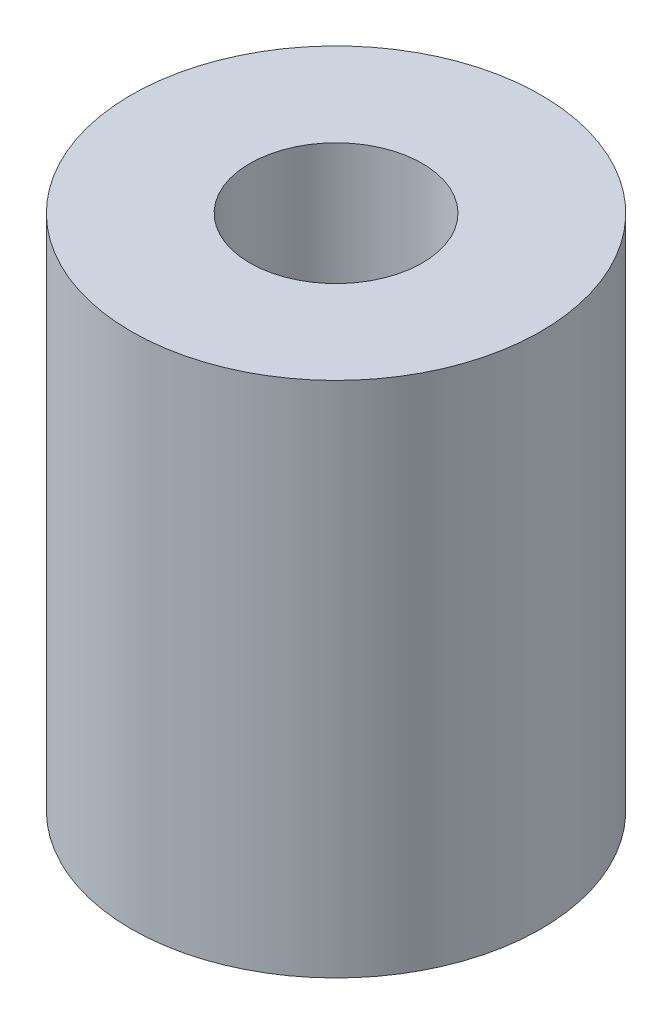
ISO-10303-21;
HEADER;
FILE_DESCRIPTION(('STEP AP214'),'2;1');
FILE_NAME('part.step','',(''),(''),'','','');
FILE_SCHEMA(('AUTOMOTIVE_DESIGN { 1 0 10303 214 1 1 1 1 }'));
ENDSEC;
DATA;
#1=APPLICATION_CONTEXT('core data for automotive mechanical design processes');
#2=APPLICATION_PROTOCOL_DEFINITION('international standard','automotive_design',2000,#1);
#3=PRODUCT_CONTEXT('',#1,'mechanical');
#4=PRODUCT('Part','Part','',(#3));
#5=PRODUCT_RELATED_PRODUCT_CATEGORY('part','',(#4));
#6=PRODUCT_DEFINITION_FORMATION('','',#4);
#7=PRODUCT_DEFINITION_CONTEXT('part definition',#1,'design');
#8=PRODUCT_DEFINITION('design','',#6,#7);
#9=PRODUCT_DEFINITION_SHAPE('','',#8);
#10=(LENGTH_UNIT() NAMED_UNIT(*) SI_UNIT(.MILLI.,.METRE.));
#11=(NAMED_UNIT(*) PLANE_ANGLE_UNIT() SI_UNIT($,.RADIAN.));
#12=(NAMED_UNIT(*) SI_UNIT($,.STERADIAN.) SOLID_ANGLE_UNIT());
#13=UNCERTAINTY_MEASURE_WITH_UNIT(LENGTH_MEASURE(1.E-05),#10,'distance_accuracy_value','');
#14=(GEOMETRIC_REPRESENTATION_CONTEXT(3) GLOBAL_UNCERTAINTY_ASSIGNED_CONTEXT((#13)) GLOBAL_UNIT_ASSIGNED_CONTEXT((#10,
#11,#12)) REPRESENTATION_CONTEXT('',''));
#15=CARTESIAN_POINT('',(0.,0.,0.));
#16=DIRECTION('',(0.,0.,1.));
#17=DIRECTION('',(1.,0.,0.));
#18=AXIS2_PLACEMENT_3D('',#15,#16,#17);
#19=CARTESIAN_POINT('',(0.,16.214782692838,0.));
#20=DIRECTION('',(0.,1.,0.));
#21=DIRECTION('',(0.,0.,1.));
#22=AXIS2_PLACEMENT_3D('',#19,#20,#21);
#23=CYLINDRICAL_SURFACE('',#22,4.);
#24=CARTESIAN_POINT('',(0.,-12.,0.));
#25=DIRECTION('',(0.,1.,0.));
#26=DIRECTION('',(0.,0.,1.));
#27=AXIS2_PLACEMENT_3D('',#24,#25,#26);
#28=CIRCLE('',#27,4.);
#29=CARTESIAN_POINT('',(0.,-12.,4.));
#30=VERTEX_POINT('',#29);
#31=EDGE_CURVE('E10',#30,#30,#28,.T.);
#32=ORIENTED_EDGE('',*,*,#31,.F.);
#33=EDGE_LOOP('',(#32));
#34=FACE_BOUND('',#33,.T.);
#35=CARTESIAN_POINT('',(0.,12.,0.));
#36=DIRECTION('',(0.,1.,0.));
#37=DIRECTION('',(0.,0.,1.));
#38=AXIS2_PLACEMENT_3D('',#35,#36,#37);
#39=CIRCLE('',#38,4.);
#40=CARTESIAN_POINT('',(0.,12.,4.));
#41=VERTEX_POINT('',#40);
#42=EDGE_CURVE('E47',#41,#41,#39,.T.);
#43=ORIENTED_EDGE('',*,*,#42,.T.);
#44=EDGE_LOOP('',(#43));
#45=FACE_BOUND('',#44,.T.);
#46=ADVANCED_FACE('F33',(#34,#45),#23,.F.);
#47=CARTESIAN_POINT('',(4.,-12.,0.));
#48=DIRECTION('',(0.,1.,0.));
#49=DIRECTION('',(0.,0.,1.));
#50=AXIS2_PLACEMENT_3D('',#47,#48,#49);
#51=PLANE('',#50);
#52=CARTESIAN_POINT('',(0.,-12.,0.));
#53=DIRECTION('',(0.,1.,0.));
#54=DIRECTION('',(0.,0.,1.));
#55=AXIS2_PLACEMENT_3D('',#52,#53,#54);
#56=CIRCLE('',#55,9.5);
#57=CARTESIAN_POINT('',(0.,-12.,9.5));
#58=VERTEX_POINT('',#57);
#59=EDGE_CURVE('E39',#58,#58,#56,.T.);
#60=ORIENTED_EDGE('',*,*,#59,.F.);
#61=EDGE_LOOP('',(#60));
#62=FACE_BOUND('',#61,.T.);
#63=ORIENTED_EDGE('',*,*,#31,.T.);
#64=EDGE_LOOP('',(#63));
#65=FACE_BOUND('',#64,.T.);
#66=ADVANCED_FACE('F62',(#62,#65),#51,.F.);
#67=CARTESIAN_POINT('',(0.,16.214782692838,0.));
#68=DIRECTION('',(0.,1.,0.));
#69=DIRECTION('',(0.,0.,1.));
#70=AXIS2_PLACEMENT_3D('',#67,#68,#69);
#71=CYLINDRICAL_SURFACE('',#70,9.5);
#72=CARTESIAN_POINT('',(0.,12.,0.));
#73=DIRECTION('',(0.,1.,0.));
#74=DIRECTION('',(0.,0.,1.));
#75=AXIS2_PLACEMENT_3D('',#72,#73,#74);
#76=CIRCLE('',#75,9.5);
#77=CARTESIAN_POINT('',(0.,12.,9.5));
#78=VERTEX_POINT('',#77);
#79=EDGE_CURVE('E43',#78,#78,#76,.T.);
#80=ORIENTED_EDGE('',*,*,#79,.F.);
#81=EDGE_LOOP('',(#80));
#82=FACE_BOUND('',#81,.T.);
#83=ORIENTED_EDGE('',*,*,#59,.T.);
#84=EDGE_LOOP('',(#83));
#85=FACE_BOUND('',#84,.T.);
#86=ADVANCED_FACE('F57',(#82,#85),#71,.T.);
#87=CARTESIAN_POINT('',(4.,12.,0.));
#88=DIRECTION('',(0.,-1.,0.));
#89=DIRECTION('',(0.,0.,-1.));
#90=AXIS2_PLACEMENT_3D('',#87,#88,#89);
#91=PLANE('',#90);
#92=ORIENTED_EDGE('',*,*,#42,.F.);
#93=EDGE_LOOP('',(#92));
#94=FACE_BOUND('',#93,.T.);
#95=ORIENTED_EDGE('',*,*,#79,.T.);
#96=EDGE_LOOP('',(#95));
#97=FACE_BOUND('',#96,.T.);
#98=ADVANCED_FACE('F54',(#94,#97),#91,.F.);
#99=CLOSED_SHELL('',(#46,#66,#86,#98));
#100=MANIFOLD_SOLID_BREP('B2',#99);
#101=ADVANCED_BREP_SHAPE_REPRESENTATION('',(#18,#100),#14);
#102=SHAPE_DEFINITION_REPRESENTATION(#9,#101);
ENDSEC;
END-ISO-10303-21;
